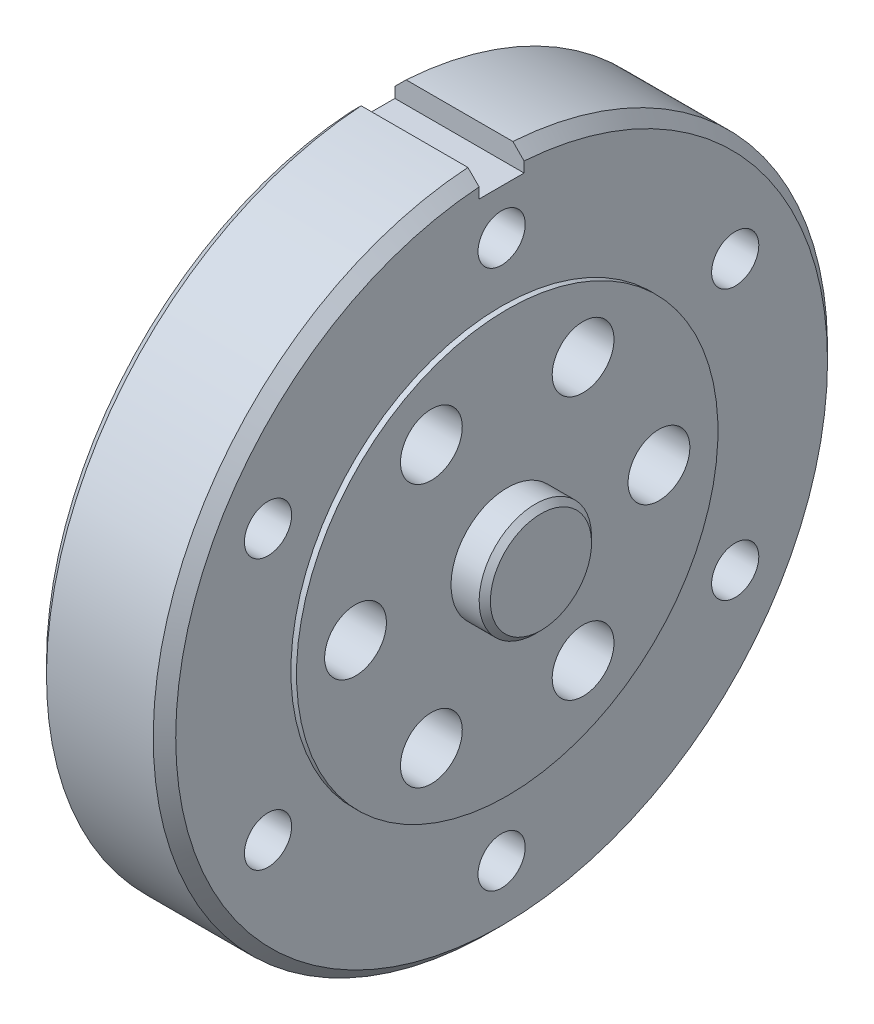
ISO-10303-21;
HEADER;
FILE_DESCRIPTION(('STEP AP214'),'2;1');
FILE_NAME('part.step','',(''),(''),'','','');
FILE_SCHEMA(('AUTOMOTIVE_DESIGN { 1 0 10303 214 1 1 1 1 }'));
ENDSEC;
DATA;
#1=APPLICATION_CONTEXT('core data for automotive mechanical design processes');
#2=APPLICATION_PROTOCOL_DEFINITION('international standard','automotive_design',2000,#1);
#3=PRODUCT_CONTEXT('',#1,'mechanical');
#4=PRODUCT('Part','Part','',(#3));
#5=PRODUCT_RELATED_PRODUCT_CATEGORY('part','',(#4));
#6=PRODUCT_DEFINITION_FORMATION('','',#4);
#7=PRODUCT_DEFINITION_CONTEXT('part definition',#1,'design');
#8=PRODUCT_DEFINITION('design','',#6,#7);
#9=PRODUCT_DEFINITION_SHAPE('','',#8);
#10=(LENGTH_UNIT() NAMED_UNIT(*) SI_UNIT(.MILLI.,.METRE.));
#11=(NAMED_UNIT(*) PLANE_ANGLE_UNIT() SI_UNIT($,.RADIAN.));
#12=(NAMED_UNIT(*) SI_UNIT($,.STERADIAN.) SOLID_ANGLE_UNIT());
#13=UNCERTAINTY_MEASURE_WITH_UNIT(LENGTH_MEASURE(1.E-05),#10,'distance_accuracy_value','');
#14=(GEOMETRIC_REPRESENTATION_CONTEXT(3) GLOBAL_UNCERTAINTY_ASSIGNED_CONTEXT((#13)) GLOBAL_UNIT_ASSIGNED_CONTEXT((#10,
#11,#12)) REPRESENTATION_CONTEXT('',''));
#15=CARTESIAN_POINT('',(0.,0.,0.));
#16=DIRECTION('',(0.,0.,1.));
#17=DIRECTION('',(1.,0.,0.));
#18=AXIS2_PLACEMENT_3D('',#15,#16,#17);
#19=CARTESIAN_POINT('',(-658.280507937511,814.165133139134,284.122324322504));
#20=DIRECTION('',(1.,0.,0.));
#21=DIRECTION('',(0.,1.,0.));
#22=AXIS2_PLACEMENT_3D('',#19,#20,#21);
#23=CYLINDRICAL_SURFACE('',#22,5.);
#24=CARTESIAN_POINT('',(-673.369845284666,814.165133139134,284.122324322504));
#25=DIRECTION('',(-1.,0.,0.));
#26=DIRECTION('',(0.,1.,0.));
#27=AXIS2_PLACEMENT_3D('',#24,#25,#26);
#28=CIRCLE('',#27,5.);
#29=CARTESIAN_POINT('',(-673.369845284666,819.165133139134,284.122324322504));
#30=VERTEX_POINT('',#29);
#31=EDGE_CURVE('E11',#30,#30,#28,.T.);
#32=ORIENTED_EDGE('',*,*,#31,.T.);
#33=EDGE_LOOP('',(#32));
#34=FACE_BOUND('',#33,.T.);
#35=CARTESIAN_POINT('',(-668.869845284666,814.165133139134,284.122324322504));
#36=DIRECTION('',(1.,0.,0.));
#37=DIRECTION('',(0.,-1.,0.));
#38=AXIS2_PLACEMENT_3D('',#35,#36,#37);
#39=CIRCLE('',#38,5.);
#40=CARTESIAN_POINT('',(-668.869845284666,809.165133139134,284.122324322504));
#41=VERTEX_POINT('',#40);
#42=EDGE_CURVE('E28',#41,#41,#39,.T.);
#43=ORIENTED_EDGE('',*,*,#42,.T.);
#44=EDGE_LOOP('',(#43));
#45=FACE_BOUND('',#44,.T.);
#46=ADVANCED_FACE('F17',(#34,#45),#23,.F.);
#47=CARTESIAN_POINT('',(-673.869845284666,814.165133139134,279.122324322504));
#48=DIRECTION('',(-1.,0.,0.));
#49=DIRECTION('',(0.,-1.,0.));
#50=AXIS2_PLACEMENT_3D('',#47,#48,#49);
#51=PLANE('',#50);
#52=DIRECTION('',(0.,-1.,0.));
#53=VECTOR('',#52,1.);
#54=CARTESIAN_POINT('',(-673.869845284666,849.311806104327,282.122324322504));
#55=LINE('',#54,#53);
#56=CARTESIAN_POINT('',(-673.869845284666,843.096085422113,282.122324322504));
#57=VERTEX_POINT('',#56);
#58=CARTESIAN_POINT('',(-673.869845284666,842.165133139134,282.122324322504));
#59=VERTEX_POINT('',#58);
#60=EDGE_CURVE('E249',#57,#59,#55,.T.);
#61=ORIENTED_EDGE('',*,*,#60,.F.);
#62=CARTESIAN_POINT('',(-673.869845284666,814.165133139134,284.122324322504));
#63=DIRECTION('',(-1.,0.,0.));
#64=DIRECTION('',(0.,1.,0.));
#65=AXIS2_PLACEMENT_3D('',#62,#63,#64);
#66=CIRCLE('',#65,29.);
#67=CARTESIAN_POINT('',(-673.869845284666,843.096085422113,286.122324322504));
#68=VERTEX_POINT('',#67);
#69=EDGE_CURVE('E293',#57,#68,#66,.T.);
#70=ORIENTED_EDGE('',*,*,#69,.T.);
#71=DIRECTION('',(0.,1.,0.));
#72=VECTOR('',#71,1.);
#73=CARTESIAN_POINT('',(-673.869845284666,849.311806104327,286.122324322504));
#74=LINE('',#73,#72);
#75=CARTESIAN_POINT('',(-673.869845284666,842.165133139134,286.122324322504));
#76=VERTEX_POINT('',#75);
#77=EDGE_CURVE('E258',#76,#68,#74,.T.);
#78=ORIENTED_EDGE('',*,*,#77,.F.);
#79=DIRECTION('',(0.,0.,1.));
#80=VECTOR('',#79,1.);
#81=CARTESIAN_POINT('',(-673.869845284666,842.165133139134,282.122324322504));
#82=LINE('',#81,#80);
#83=EDGE_CURVE('E266',#59,#76,#82,.T.);
#84=ORIENTED_EDGE('',*,*,#83,.F.);
#85=EDGE_LOOP('',(#61,#70,#78,#84));
#86=FACE_BOUND('',#85,.T.);
#87=CARTESIAN_POINT('',(-673.869845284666,814.165133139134,284.122324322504));
#88=DIRECTION('',(1.,0.,0.));
#89=DIRECTION('',(0.,1.,0.));
#90=AXIS2_PLACEMENT_3D('',#87,#88,#89);
#91=CIRCLE('',#90,5.5);
#92=CARTESIAN_POINT('',(-673.869845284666,819.665133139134,284.122324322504));
#93=VERTEX_POINT('',#92);
#94=EDGE_CURVE('E289',#93,#93,#91,.T.);
#95=ORIENTED_EDGE('',*,*,#94,.T.);
#96=EDGE_LOOP('',(#95));
#97=FACE_BOUND('',#96,.T.);
#98=CARTESIAN_POINT('',(-673.869845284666,802.165133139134,263.337714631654));
#99=DIRECTION('',(-1.,0.,0.));
#100=DIRECTION('',(0.,1.,0.));
#101=AXIS2_PLACEMENT_3D('',#98,#99,#100);
#102=CIRCLE('',#101,2.1);
#103=CARTESIAN_POINT('',(-673.869845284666,804.265133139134,263.337714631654));
#104=VERTEX_POINT('',#103);
#105=EDGE_CURVE('E274',#104,#104,#102,.T.);
#106=ORIENTED_EDGE('',*,*,#105,.F.);
#107=EDGE_LOOP('',(#106));
#108=FACE_BOUND('',#107,.T.);
#109=CARTESIAN_POINT('',(-673.869845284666,790.165133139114,284.122324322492));
#110=DIRECTION('',(-1.,0.,0.));
#111=DIRECTION('',(0.,1.,0.));
#112=AXIS2_PLACEMENT_3D('',#109,#110,#111);
#113=CIRCLE('',#112,2.1);
#114=CARTESIAN_POINT('',(-673.869845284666,792.265133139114,284.122324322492));
#115=VERTEX_POINT('',#114);
#116=EDGE_CURVE('E299',#115,#115,#113,.T.);
#117=ORIENTED_EDGE('',*,*,#116,.F.);
#118=EDGE_LOOP('',(#117));
#119=FACE_BOUND('',#118,.T.);
#120=CARTESIAN_POINT('',(-673.869845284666,802.165133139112,304.906934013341));
#121=DIRECTION('',(-1.,0.,0.));
#122=DIRECTION('',(0.,1.,0.));
#123=AXIS2_PLACEMENT_3D('',#120,#121,#122);
#124=CIRCLE('',#123,2.1);
#125=CARTESIAN_POINT('',(-673.869845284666,804.265133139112,304.906934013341));
#126=VERTEX_POINT('',#125);
#127=EDGE_CURVE('E304',#126,#126,#124,.T.);
#128=ORIENTED_EDGE('',*,*,#127,.F.);
#129=EDGE_LOOP('',(#128));
#130=FACE_BOUND('',#129,.T.);
#131=CARTESIAN_POINT('',(-673.869845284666,826.165133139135,304.906934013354));
#132=DIRECTION('',(-1.,0.,0.));
#133=DIRECTION('',(0.,1.,0.));
#134=AXIS2_PLACEMENT_3D('',#131,#132,#133);
#135=CIRCLE('',#134,2.1);
#136=CARTESIAN_POINT('',(-673.869845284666,828.265133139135,304.906934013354));
#137=VERTEX_POINT('',#136);
#138=EDGE_CURVE('E309',#137,#137,#135,.T.);
#139=ORIENTED_EDGE('',*,*,#138,.F.);
#140=EDGE_LOOP('',(#139));
#141=FACE_BOUND('',#140,.T.);
#142=CARTESIAN_POINT('',(-673.869845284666,838.165133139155,284.122324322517));
#143=DIRECTION('',(-1.,0.,0.));
#144=DIRECTION('',(0.,1.,0.));
#145=AXIS2_PLACEMENT_3D('',#142,#143,#144);
#146=CIRCLE('',#145,2.1);
#147=CARTESIAN_POINT('',(-673.869845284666,840.265133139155,284.122324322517));
#148=VERTEX_POINT('',#147);
#149=EDGE_CURVE('E314',#148,#148,#146,.T.);
#150=ORIENTED_EDGE('',*,*,#149,.F.);
#151=EDGE_LOOP('',(#150));
#152=FACE_BOUND('',#151,.T.);
#153=CARTESIAN_POINT('',(-673.869845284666,826.165133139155,263.337714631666));
#154=DIRECTION('',(-1.,0.,0.));
#155=DIRECTION('',(0.,1.,0.));
#156=AXIS2_PLACEMENT_3D('',#153,#154,#155);
#157=CIRCLE('',#156,2.1);
#158=CARTESIAN_POINT('',(-673.869845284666,828.265133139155,263.337714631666));
#159=VERTEX_POINT('',#158);
#160=EDGE_CURVE('E319',#159,#159,#157,.T.);
#161=ORIENTED_EDGE('',*,*,#160,.F.);
#162=EDGE_LOOP('',(#161));
#163=FACE_BOUND('',#162,.T.);
#164=CARTESIAN_POINT('',(-673.869845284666,802.473790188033,290.872324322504));
#165=DIRECTION('',(-1.,0.,0.));
#166=DIRECTION('',(0.,1.,0.));
#167=AXIS2_PLACEMENT_3D('',#164,#165,#166);
#168=CIRCLE('',#167,5.00000000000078);
#169=CARTESIAN_POINT('',(-673.869845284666,807.473790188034,290.872324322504));
#170=VERTEX_POINT('',#169);
#171=EDGE_CURVE('E205',#170,#170,#168,.T.);
#172=ORIENTED_EDGE('',*,*,#171,.F.);
#173=EDGE_LOOP('',(#172));
#174=FACE_BOUND('',#173,.T.);
#175=CARTESIAN_POINT('',(-673.869845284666,814.165133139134,297.622324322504));
#176=DIRECTION('',(-1.,0.,0.));
#177=DIRECTION('',(0.,1.,0.));
#178=AXIS2_PLACEMENT_3D('',#175,#176,#177);
#179=CIRCLE('',#178,4.99999999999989);
#180=CARTESIAN_POINT('',(-673.869845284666,819.165133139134,297.622324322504));
#181=VERTEX_POINT('',#180);
#182=EDGE_CURVE('E204',#181,#181,#179,.T.);
#183=ORIENTED_EDGE('',*,*,#182,.F.);
#184=EDGE_LOOP('',(#183));
#185=FACE_BOUND('',#184,.T.);
#186=CARTESIAN_POINT('',(-673.869845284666,825.856476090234,290.872324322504));
#187=DIRECTION('',(-1.,0.,0.));
#188=DIRECTION('',(0.,1.,0.));
#189=AXIS2_PLACEMENT_3D('',#186,#187,#188);
#190=CIRCLE('',#189,4.99999999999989);
#191=CARTESIAN_POINT('',(-673.869845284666,830.856476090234,290.872324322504));
#192=VERTEX_POINT('',#191);
#193=EDGE_CURVE('E324',#192,#192,#190,.T.);
#194=ORIENTED_EDGE('',*,*,#193,.F.);
#195=EDGE_LOOP('',(#194));
#196=FACE_BOUND('',#195,.T.);
#197=CARTESIAN_POINT('',(-673.869845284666,825.856476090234,277.372324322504));
#198=DIRECTION('',(-1.,0.,0.));
#199=DIRECTION('',(0.,1.,0.));
#200=AXIS2_PLACEMENT_3D('',#197,#198,#199);
#201=CIRCLE('',#200,4.99999999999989);
#202=CARTESIAN_POINT('',(-673.869845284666,830.856476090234,277.372324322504));
#203=VERTEX_POINT('',#202);
#204=EDGE_CURVE('E329',#203,#203,#201,.T.);
#205=ORIENTED_EDGE('',*,*,#204,.F.);
#206=EDGE_LOOP('',(#205));
#207=FACE_BOUND('',#206,.T.);
#208=CARTESIAN_POINT('',(-673.869845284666,814.165133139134,270.622324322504));
#209=DIRECTION('',(-1.,0.,0.));
#210=DIRECTION('',(0.,1.,0.));
#211=AXIS2_PLACEMENT_3D('',#208,#209,#210);
#212=CIRCLE('',#211,4.99999999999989);
#213=CARTESIAN_POINT('',(-673.869845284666,819.165133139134,270.622324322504));
#214=VERTEX_POINT('',#213);
#215=EDGE_CURVE('E333',#214,#214,#212,.T.);
#216=ORIENTED_EDGE('',*,*,#215,.F.);
#217=EDGE_LOOP('',(#216));
#218=FACE_BOUND('',#217,.T.);
#219=CARTESIAN_POINT('',(-673.869845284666,802.473790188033,277.372324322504));
#220=DIRECTION('',(-1.,0.,0.));
#221=DIRECTION('',(0.,1.,0.));
#222=AXIS2_PLACEMENT_3D('',#219,#220,#221);
#223=CIRCLE('',#222,5.00000000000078);
#224=CARTESIAN_POINT('',(-673.869845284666,807.473790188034,277.372324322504));
#225=VERTEX_POINT('',#224);
#226=EDGE_CURVE('E338',#225,#225,#223,.T.);
#227=ORIENTED_EDGE('',*,*,#226,.F.);
#228=EDGE_LOOP('',(#227));
#229=FACE_BOUND('',#228,.T.);
#230=ADVANCED_FACE('F470',(#86,#97,#108,#119,#130,#141,#152,#163,#174,#185,#196,#207,#218,#229),
#51,.T.);
#231=CARTESIAN_POINT('',(-658.280507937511,814.165133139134,284.122324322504));
#232=DIRECTION('',(1.,0.,0.));
#233=DIRECTION('',(0.,1.,0.));
#234=AXIS2_PLACEMENT_3D('',#231,#232,#233);
#235=CYLINDRICAL_SURFACE('',#234,30.);
#236=DIRECTION('',(-1.,0.,0.));
#237=VECTOR('',#236,1.);
#238=CARTESIAN_POINT('',(-658.280507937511,844.098392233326,282.122324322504));
#239=LINE('',#238,#237);
#240=CARTESIAN_POINT('',(-663.369845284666,844.098392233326,282.122324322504));
#241=VERTEX_POINT('',#240);
#242=CARTESIAN_POINT('',(-672.869845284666,844.098392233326,282.122324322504));
#243=VERTEX_POINT('',#242);
#244=EDGE_CURVE('E229',#241,#243,#239,.T.);
#245=ORIENTED_EDGE('',*,*,#244,.F.);
#246=CARTESIAN_POINT('',(-663.369845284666,814.165133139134,284.122324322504));
#247=DIRECTION('',(-1.,0.,0.));
#248=DIRECTION('',(0.,-1.,0.));
#249=AXIS2_PLACEMENT_3D('',#246,#247,#248);
#250=CIRCLE('',#249,30.);
#251=CARTESIAN_POINT('',(-663.369845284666,844.098392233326,286.122324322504));
#252=VERTEX_POINT('',#251);
#253=EDGE_CURVE('E294',#241,#252,#250,.T.);
#254=ORIENTED_EDGE('',*,*,#253,.T.);
#255=DIRECTION('',(1.,0.,0.));
#256=VECTOR('',#255,1.);
#257=CARTESIAN_POINT('',(-658.280507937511,844.098392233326,286.122324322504));
#258=LINE('',#257,#256);
#259=CARTESIAN_POINT('',(-672.869845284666,844.098392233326,286.122324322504));
#260=VERTEX_POINT('',#259);
#261=EDGE_CURVE('E239',#260,#252,#258,.T.);
#262=ORIENTED_EDGE('',*,*,#261,.F.);
#263=CARTESIAN_POINT('',(-672.869845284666,814.165133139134,284.122324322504));
#264=DIRECTION('',(1.,0.,0.));
#265=DIRECTION('',(0.,1.,0.));
#266=AXIS2_PLACEMENT_3D('',#263,#264,#265);
#267=CIRCLE('',#266,30.);
#268=EDGE_CURVE('E348',#260,#243,#267,.T.);
#269=ORIENTED_EDGE('',*,*,#268,.T.);
#270=EDGE_LOOP('',(#245,#254,#262,#269));
#271=FACE_BOUND('',#270,.T.);
#272=ADVANCED_FACE('F476',(#271),#235,.T.);
#273=CARTESIAN_POINT('',(-662.369845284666,814.165133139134,265.372324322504));
#274=DIRECTION('',(1.,0.,0.));
#275=DIRECTION('',(0.,1.,0.));
#276=AXIS2_PLACEMENT_3D('',#273,#274,#275);
#277=PLANE('',#276);
#278=DIRECTION('',(0.,1.,0.));
#279=VECTOR('',#278,1.);
#280=CARTESIAN_POINT('',(-662.369845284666,814.165133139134,282.122324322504));
#281=LINE('',#280,#279);
#282=CARTESIAN_POINT('',(-662.369845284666,842.165133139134,282.122324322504));
#283=VERTEX_POINT('',#282);
#284=CARTESIAN_POINT('',(-662.369845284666,843.096085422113,282.122324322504));
#285=VERTEX_POINT('',#284);
#286=EDGE_CURVE('E228',#283,#285,#281,.T.);
#287=ORIENTED_EDGE('',*,*,#286,.F.);
#288=DIRECTION('',(0.,0.,-1.));
#289=VECTOR('',#288,1.);
#290=CARTESIAN_POINT('',(-662.369845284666,842.165133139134,265.372324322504));
#291=LINE('',#290,#289);
#292=CARTESIAN_POINT('',(-662.369845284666,842.165133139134,286.122324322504));
#293=VERTEX_POINT('',#292);
#294=EDGE_CURVE('E265',#293,#283,#291,.T.);
#295=ORIENTED_EDGE('',*,*,#294,.F.);
#296=DIRECTION('',(0.,-1.,0.));
#297=VECTOR('',#296,1.);
#298=CARTESIAN_POINT('',(-662.369845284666,814.165133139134,286.122324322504));
#299=LINE('',#298,#297);
#300=CARTESIAN_POINT('',(-662.369845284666,843.096085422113,286.122324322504));
#301=VERTEX_POINT('',#300);
#302=EDGE_CURVE('E355',#301,#293,#299,.T.);
#303=ORIENTED_EDGE('',*,*,#302,.F.);
#304=CARTESIAN_POINT('',(-662.369845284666,814.165133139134,284.122324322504));
#305=DIRECTION('',(1.,0.,0.));
#306=DIRECTION('',(0.,-1.,0.));
#307=AXIS2_PLACEMENT_3D('',#304,#305,#306);
#308=CIRCLE('',#307,29.);
#309=EDGE_CURVE('E353',#301,#285,#308,.T.);
#310=ORIENTED_EDGE('',*,*,#309,.T.);
#311=EDGE_LOOP('',(#287,#295,#303,#310));
#312=FACE_BOUND('',#311,.T.);
#313=CARTESIAN_POINT('',(-662.369845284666,802.165133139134,263.337714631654));
#314=DIRECTION('',(1.,0.,0.));
#315=DIRECTION('',(0.,-1.,0.));
#316=AXIS2_PLACEMENT_3D('',#313,#314,#315);
#317=CIRCLE('',#316,2.1);
#318=CARTESIAN_POINT('',(-662.369845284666,800.065133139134,263.337714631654));
#319=VERTEX_POINT('',#318);
#320=EDGE_CURVE('E298',#319,#319,#317,.T.);
#321=ORIENTED_EDGE('',*,*,#320,.F.);
#322=EDGE_LOOP('',(#321));
#323=FACE_BOUND('',#322,.T.);
#324=CARTESIAN_POINT('',(-662.369845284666,790.165133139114,284.122324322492));
#325=DIRECTION('',(1.,0.,0.));
#326=DIRECTION('',(0.,-1.,0.));
#327=AXIS2_PLACEMENT_3D('',#324,#325,#326);
#328=CIRCLE('',#327,2.1);
#329=CARTESIAN_POINT('',(-662.369845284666,788.065133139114,284.122324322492));
#330=VERTEX_POINT('',#329);
#331=EDGE_CURVE('E303',#330,#330,#328,.T.);
#332=ORIENTED_EDGE('',*,*,#331,.F.);
#333=EDGE_LOOP('',(#332));
#334=FACE_BOUND('',#333,.T.);
#335=CARTESIAN_POINT('',(-662.369845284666,802.165133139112,304.906934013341));
#336=DIRECTION('',(1.,0.,0.));
#337=DIRECTION('',(0.,-1.,0.));
#338=AXIS2_PLACEMENT_3D('',#335,#336,#337);
#339=CIRCLE('',#338,2.1);
#340=CARTESIAN_POINT('',(-662.369845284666,800.065133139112,304.906934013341));
#341=VERTEX_POINT('',#340);
#342=EDGE_CURVE('E308',#341,#341,#339,.T.);
#343=ORIENTED_EDGE('',*,*,#342,.F.);
#344=EDGE_LOOP('',(#343));
#345=FACE_BOUND('',#344,.T.);
#346=CARTESIAN_POINT('',(-662.369845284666,826.165133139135,304.906934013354));
#347=DIRECTION('',(1.,0.,0.));
#348=DIRECTION('',(0.,-1.,0.));
#349=AXIS2_PLACEMENT_3D('',#346,#347,#348);
#350=CIRCLE('',#349,2.1);
#351=CARTESIAN_POINT('',(-662.369845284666,824.065133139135,304.906934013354));
#352=VERTEX_POINT('',#351);
#353=EDGE_CURVE('E313',#352,#352,#350,.T.);
#354=ORIENTED_EDGE('',*,*,#353,.F.);
#355=EDGE_LOOP('',(#354));
#356=FACE_BOUND('',#355,.T.);
#357=CARTESIAN_POINT('',(-662.369845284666,838.165133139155,284.122324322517));
#358=DIRECTION('',(1.,0.,0.));
#359=DIRECTION('',(0.,-1.,0.));
#360=AXIS2_PLACEMENT_3D('',#357,#358,#359);
#361=CIRCLE('',#360,2.1);
#362=CARTESIAN_POINT('',(-662.369845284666,836.065133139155,284.122324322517));
#363=VERTEX_POINT('',#362);
#364=EDGE_CURVE('E318',#363,#363,#361,.T.);
#365=ORIENTED_EDGE('',*,*,#364,.F.);
#366=EDGE_LOOP('',(#365));
#367=FACE_BOUND('',#366,.T.);
#368=CARTESIAN_POINT('',(-662.369845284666,826.165133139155,263.337714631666));
#369=DIRECTION('',(1.,0.,0.));
#370=DIRECTION('',(0.,-1.,0.));
#371=AXIS2_PLACEMENT_3D('',#368,#369,#370);
#372=CIRCLE('',#371,2.1);
#373=CARTESIAN_POINT('',(-662.369845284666,824.065133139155,263.337714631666));
#374=VERTEX_POINT('',#373);
#375=EDGE_CURVE('E322',#374,#374,#372,.T.);
#376=ORIENTED_EDGE('',*,*,#375,.F.);
#377=EDGE_LOOP('',(#376));
#378=FACE_BOUND('',#377,.T.);
#379=CARTESIAN_POINT('',(-662.369845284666,814.165133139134,284.122324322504));
#380=DIRECTION('',(1.,0.,0.));
#381=DIRECTION('',(0.,-1.,0.));
#382=AXIS2_PLACEMENT_3D('',#379,#380,#381);
#383=CIRCLE('',#382,18.75);
#384=CARTESIAN_POINT('',(-662.369845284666,795.415133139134,284.122324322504));
#385=VERTEX_POINT('',#384);
#386=EDGE_CURVE('E361',#385,#385,#383,.T.);
#387=ORIENTED_EDGE('',*,*,#386,.F.);
#388=EDGE_LOOP('',(#387));
#389=FACE_BOUND('',#388,.T.);
#390=ADVANCED_FACE('F483',(#312,#323,#334,#345,#356,#367,#378,#389),#277,.T.);
#391=CARTESIAN_POINT('',(-658.280507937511,814.165133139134,284.122324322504));
#392=DIRECTION('',(1.,0.,0.));
#393=DIRECTION('',(0.,1.,0.));
#394=AXIS2_PLACEMENT_3D('',#391,#392,#393);
#395=CYLINDRICAL_SURFACE('',#394,18.75);
#396=ORIENTED_EDGE('',*,*,#386,.T.);
#397=EDGE_LOOP('',(#396));
#398=FACE_BOUND('',#397,.T.);
#399=CARTESIAN_POINT('',(-661.869845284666,814.165133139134,284.122324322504));
#400=DIRECTION('',(1.,0.,0.));
#401=DIRECTION('',(0.,-1.,0.));
#402=AXIS2_PLACEMENT_3D('',#399,#400,#401);
#403=CIRCLE('',#402,18.75);
#404=CARTESIAN_POINT('',(-661.869845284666,795.415133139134,284.122324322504));
#405=VERTEX_POINT('',#404);
#406=EDGE_CURVE('E383',#405,#405,#403,.T.);
#407=ORIENTED_EDGE('',*,*,#406,.F.);
#408=EDGE_LOOP('',(#407));
#409=FACE_BOUND('',#408,.T.);
#410=ADVANCED_FACE('F487',(#398,#409),#395,.T.);
#411=CARTESIAN_POINT('',(-661.869845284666,814.165133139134,279.122324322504));
#412=DIRECTION('',(1.,0.,0.));
#413=DIRECTION('',(0.,1.,0.));
#414=AXIS2_PLACEMENT_3D('',#411,#412,#413);
#415=PLANE('',#414);
#416=CARTESIAN_POINT('',(-661.869845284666,825.856476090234,290.872324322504));
#417=DIRECTION('',(1.,0.,0.));
#418=DIRECTION('',(0.,-1.,0.));
#419=AXIS2_PLACEMENT_3D('',#416,#417,#418);
#420=CIRCLE('',#419,2.74999999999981);
#421=CARTESIAN_POINT('',(-661.869845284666,823.106476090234,290.872324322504));
#422=VERTEX_POINT('',#421);
#423=EDGE_CURVE('E388',#422,#422,#420,.T.);
#424=ORIENTED_EDGE('',*,*,#423,.F.);
#425=EDGE_LOOP('',(#424));
#426=FACE_BOUND('',#425,.T.);
#427=CARTESIAN_POINT('',(-661.869845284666,814.165133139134,297.622324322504));
#428=DIRECTION('',(1.,0.,0.));
#429=DIRECTION('',(0.,-1.,0.));
#430=AXIS2_PLACEMENT_3D('',#427,#428,#429);
#431=CIRCLE('',#430,2.74999999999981);
#432=CARTESIAN_POINT('',(-661.869845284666,811.415133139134,297.622324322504));
#433=VERTEX_POINT('',#432);
#434=EDGE_CURVE('E393',#433,#433,#431,.T.);
#435=ORIENTED_EDGE('',*,*,#434,.F.);
#436=EDGE_LOOP('',(#435));
#437=FACE_BOUND('',#436,.T.);
#438=CARTESIAN_POINT('',(-661.869845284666,802.473790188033,290.872324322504));
#439=DIRECTION('',(1.,0.,0.));
#440=DIRECTION('',(0.,-1.,0.));
#441=AXIS2_PLACEMENT_3D('',#438,#439,#440);
#442=CIRCLE('',#441,2.7500000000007);
#443=CARTESIAN_POINT('',(-661.869845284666,799.723790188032,290.872324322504));
#444=VERTEX_POINT('',#443);
#445=EDGE_CURVE('E397',#444,#444,#442,.T.);
#446=ORIENTED_EDGE('',*,*,#445,.F.);
#447=EDGE_LOOP('',(#446));
#448=FACE_BOUND('',#447,.T.);
#449=CARTESIAN_POINT('',(-661.869845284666,825.856476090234,277.372324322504));
#450=DIRECTION('',(1.,0.,0.));
#451=DIRECTION('',(0.,-1.,0.));
#452=AXIS2_PLACEMENT_3D('',#449,#450,#451);
#453=CIRCLE('',#452,2.74999999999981);
#454=CARTESIAN_POINT('',(-661.869845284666,823.106476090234,277.372324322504));
#455=VERTEX_POINT('',#454);
#456=EDGE_CURVE('E402',#455,#455,#453,.T.);
#457=ORIENTED_EDGE('',*,*,#456,.F.);
#458=EDGE_LOOP('',(#457));
#459=FACE_BOUND('',#458,.T.);
#460=CARTESIAN_POINT('',(-661.869845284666,814.165133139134,270.622324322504));
#461=DIRECTION('',(1.,0.,0.));
#462=DIRECTION('',(0.,-1.,0.));
#463=AXIS2_PLACEMENT_3D('',#460,#461,#462);
#464=CIRCLE('',#463,2.74999999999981);
#465=CARTESIAN_POINT('',(-661.869845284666,811.415133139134,270.622324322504));
#466=VERTEX_POINT('',#465);
#467=EDGE_CURVE('E407',#466,#466,#464,.T.);
#468=ORIENTED_EDGE('',*,*,#467,.F.);
#469=EDGE_LOOP('',(#468));
#470=FACE_BOUND('',#469,.T.);
#471=CARTESIAN_POINT('',(-661.869845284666,802.473790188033,277.372324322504));
#472=DIRECTION('',(1.,0.,0.));
#473=DIRECTION('',(0.,-1.,0.));
#474=AXIS2_PLACEMENT_3D('',#471,#472,#473);
#475=CIRCLE('',#474,2.7500000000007);
#476=CARTESIAN_POINT('',(-661.869845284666,799.723790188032,277.372324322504));
#477=VERTEX_POINT('',#476);
#478=EDGE_CURVE('E217',#477,#477,#475,.T.);
#479=ORIENTED_EDGE('',*,*,#478,.F.);
#480=EDGE_LOOP('',(#479));
#481=FACE_BOUND('',#480,.T.);
#482=ORIENTED_EDGE('',*,*,#406,.T.);
#483=EDGE_LOOP('',(#482));
#484=FACE_BOUND('',#483,.T.);
#485=CARTESIAN_POINT('',(-661.869845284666,814.165133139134,284.122324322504));
#486=DIRECTION('',(1.,0.,0.));
#487=DIRECTION('',(0.,-1.,0.));
#488=AXIS2_PLACEMENT_3D('',#485,#486,#487);
#489=CIRCLE('',#488,5.);
#490=CARTESIAN_POINT('',(-661.869845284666,809.165133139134,284.122324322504));
#491=VERTEX_POINT('',#490);
#492=EDGE_CURVE('E415',#491,#491,#489,.T.);
#493=ORIENTED_EDGE('',*,*,#492,.F.);
#494=EDGE_LOOP('',(#493));
#495=FACE_BOUND('',#494,.T.);
#496=ADVANCED_FACE('F491',(#426,#437,#448,#459,#470,#481,#484,#495),#415,.T.);
#497=CARTESIAN_POINT('',(-658.280507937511,814.165133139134,284.122324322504));
#498=DIRECTION('',(1.,0.,0.));
#499=DIRECTION('',(0.,1.,0.));
#500=AXIS2_PLACEMENT_3D('',#497,#498,#499);
#501=CYLINDRICAL_SURFACE('',#500,5.);
#502=CARTESIAN_POINT('',(-659.369845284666,814.165133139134,284.122324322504));
#503=DIRECTION('',(-1.,0.,0.));
#504=DIRECTION('',(0.,-1.,0.));
#505=AXIS2_PLACEMENT_3D('',#502,#503,#504);
#506=CIRCLE('',#505,5.);
#507=CARTESIAN_POINT('',(-659.369845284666,809.165133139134,284.122324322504));
#508=VERTEX_POINT('',#507);
#509=EDGE_CURVE('E387',#508,#508,#506,.T.);
#510=ORIENTED_EDGE('',*,*,#509,.T.);
#511=EDGE_LOOP('',(#510));
#512=FACE_BOUND('',#511,.T.);
#513=ORIENTED_EDGE('',*,*,#492,.T.);
#514=EDGE_LOOP('',(#513));
#515=FACE_BOUND('',#514,.T.);
#516=ADVANCED_FACE('F495',(#512,#515),#501,.T.);
#517=CARTESIAN_POINT('',(-658.869845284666,814.165133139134,284.122324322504));
#518=DIRECTION('',(1.,0.,0.));
#519=DIRECTION('',(0.,1.,0.));
#520=AXIS2_PLACEMENT_3D('',#517,#518,#519);
#521=PLANE('',#520);
#522=CARTESIAN_POINT('',(-658.869845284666,814.165133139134,284.122324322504));
#523=DIRECTION('',(1.,0.,0.));
#524=DIRECTION('',(0.,-1.,0.));
#525=AXIS2_PLACEMENT_3D('',#522,#523,#524);
#526=CIRCLE('',#525,4.5);
#527=CARTESIAN_POINT('',(-658.869845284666,809.665133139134,284.122324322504));
#528=VERTEX_POINT('',#527);
#529=EDGE_CURVE('E419',#528,#528,#526,.T.);
#530=ORIENTED_EDGE('',*,*,#529,.T.);
#531=EDGE_LOOP('',(#530));
#532=FACE_BOUND('',#531,.T.);
#533=ADVANCED_FACE('F499',(#532),#521,.T.);
#534=CARTESIAN_POINT('',(-668.869845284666,814.165133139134,284.122324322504));
#535=DIRECTION('',(-1.,0.,0.));
#536=DIRECTION('',(0.,-1.,0.));
#537=AXIS2_PLACEMENT_3D('',#534,#535,#536);
#538=PLANE('',#537);
#539=ORIENTED_EDGE('',*,*,#42,.F.);
#540=EDGE_LOOP('',(#539));
#541=FACE_BOUND('',#540,.T.);
#542=ADVANCED_FACE('F503',(#541),#538,.T.);
#543=CARTESIAN_POINT('',(-667.369845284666,814.165133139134,279.122324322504));
#544=DIRECTION('',(1.,0.,0.));
#545=DIRECTION('',(0.,1.,0.));
#546=AXIS2_PLACEMENT_3D('',#543,#544,#545);
#547=PLANE('',#546);
#548=CARTESIAN_POINT('',(-667.369845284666,802.473790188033,277.372324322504));
#549=DIRECTION('',(-1.,0.,0.));
#550=DIRECTION('',(0.,1.,0.));
#551=AXIS2_PLACEMENT_3D('',#548,#549,#550);
#552=CIRCLE('',#551,2.7500000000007);
#553=CARTESIAN_POINT('',(-667.369845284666,805.223790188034,277.372324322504));
#554=VERTEX_POINT('',#553);
#555=EDGE_CURVE('E411',#554,#554,#552,.T.);
#556=ORIENTED_EDGE('',*,*,#555,.F.);
#557=EDGE_LOOP('',(#556));
#558=FACE_BOUND('',#557,.T.);
#559=CARTESIAN_POINT('',(-667.369845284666,802.473790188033,277.372324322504));
#560=DIRECTION('',(-1.,0.,0.));
#561=DIRECTION('',(0.,-1.,0.));
#562=AXIS2_PLACEMENT_3D('',#559,#560,#561);
#563=CIRCLE('',#562,5.00000000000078);
#564=CARTESIAN_POINT('',(-667.369845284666,797.473790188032,277.372324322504));
#565=VERTEX_POINT('',#564);
#566=EDGE_CURVE('E342',#565,#565,#563,.T.);
#567=ORIENTED_EDGE('',*,*,#566,.T.);
#568=EDGE_LOOP('',(#567));
#569=FACE_BOUND('',#568,.T.);
#570=ADVANCED_FACE('F507',(#558,#569),#547,.F.);
#571=CARTESIAN_POINT('',(-647.727709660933,802.473790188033,277.372324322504));
#572=DIRECTION('',(-1.,0.,0.));
#573=DIRECTION('',(0.,-1.,0.));
#574=AXIS2_PLACEMENT_3D('',#571,#572,#573);
#575=CYLINDRICAL_SURFACE('',#574,5.00000000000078);
#576=ORIENTED_EDGE('',*,*,#226,.T.);
#577=EDGE_LOOP('',(#576));
#578=FACE_BOUND('',#577,.T.);
#579=ORIENTED_EDGE('',*,*,#566,.F.);
#580=EDGE_LOOP('',(#579));
#581=FACE_BOUND('',#580,.T.);
#582=ADVANCED_FACE('F511',(#578,#581),#575,.F.);
#583=CARTESIAN_POINT('',(-667.369845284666,814.165133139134,279.122324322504));
#584=DIRECTION('',(1.,0.,0.));
#585=DIRECTION('',(0.,1.,0.));
#586=AXIS2_PLACEMENT_3D('',#583,#584,#585);
#587=PLANE('',#586);
#588=CARTESIAN_POINT('',(-667.369845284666,814.165133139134,270.622324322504));
#589=DIRECTION('',(-1.,0.,0.));
#590=DIRECTION('',(0.,1.,0.));
#591=AXIS2_PLACEMENT_3D('',#588,#589,#590);
#592=CIRCLE('',#591,2.74999999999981);
#593=CARTESIAN_POINT('',(-667.369845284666,816.915133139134,270.622324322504));
#594=VERTEX_POINT('',#593);
#595=EDGE_CURVE('E406',#594,#594,#592,.T.);
#596=ORIENTED_EDGE('',*,*,#595,.F.);
#597=EDGE_LOOP('',(#596));
#598=FACE_BOUND('',#597,.T.);
#599=CARTESIAN_POINT('',(-667.369845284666,814.165133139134,270.622324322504));
#600=DIRECTION('',(-1.,0.,0.));
#601=DIRECTION('',(0.,-1.,0.));
#602=AXIS2_PLACEMENT_3D('',#599,#600,#601);
#603=CIRCLE('',#602,4.99999999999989);
#604=CARTESIAN_POINT('',(-667.369845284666,809.165133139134,270.622324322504));
#605=VERTEX_POINT('',#604);
#606=EDGE_CURVE('E337',#605,#605,#603,.T.);
#607=ORIENTED_EDGE('',*,*,#606,.T.);
#608=EDGE_LOOP('',(#607));
#609=FACE_BOUND('',#608,.T.);
#610=ADVANCED_FACE('F515',(#598,#609),#587,.F.);
#611=CARTESIAN_POINT('',(-647.727709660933,814.165133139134,270.622324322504));
#612=DIRECTION('',(-1.,0.,0.));
#613=DIRECTION('',(0.,-1.,0.));
#614=AXIS2_PLACEMENT_3D('',#611,#612,#613);
#615=CYLINDRICAL_SURFACE('',#614,4.99999999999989);
#616=ORIENTED_EDGE('',*,*,#215,.T.);
#617=EDGE_LOOP('',(#616));
#618=FACE_BOUND('',#617,.T.);
#619=ORIENTED_EDGE('',*,*,#606,.F.);
#620=EDGE_LOOP('',(#619));
#621=FACE_BOUND('',#620,.T.);
#622=ADVANCED_FACE('F519',(#618,#621),#615,.F.);
#623=CARTESIAN_POINT('',(-667.369845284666,814.165133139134,279.122324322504));
#624=DIRECTION('',(1.,0.,0.));
#625=DIRECTION('',(0.,1.,0.));
#626=AXIS2_PLACEMENT_3D('',#623,#624,#625);
#627=PLANE('',#626);
#628=CARTESIAN_POINT('',(-667.369845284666,825.856476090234,277.372324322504));
#629=DIRECTION('',(-1.,0.,0.));
#630=DIRECTION('',(0.,1.,0.));
#631=AXIS2_PLACEMENT_3D('',#628,#629,#630);
#632=CIRCLE('',#631,2.74999999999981);
#633=CARTESIAN_POINT('',(-667.369845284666,828.606476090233,277.372324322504));
#634=VERTEX_POINT('',#633);
#635=EDGE_CURVE('E401',#634,#634,#632,.T.);
#636=ORIENTED_EDGE('',*,*,#635,.F.);
#637=EDGE_LOOP('',(#636));
#638=FACE_BOUND('',#637,.T.);
#639=CARTESIAN_POINT('',(-667.369845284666,825.856476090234,277.372324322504));
#640=DIRECTION('',(-1.,0.,0.));
#641=DIRECTION('',(0.,-1.,0.));
#642=AXIS2_PLACEMENT_3D('',#639,#640,#641);
#643=CIRCLE('',#642,4.99999999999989);
#644=CARTESIAN_POINT('',(-667.369845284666,820.856476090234,277.372324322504));
#645=VERTEX_POINT('',#644);
#646=EDGE_CURVE('E332',#645,#645,#643,.T.);
#647=ORIENTED_EDGE('',*,*,#646,.T.);
#648=EDGE_LOOP('',(#647));
#649=FACE_BOUND('',#648,.T.);
#650=ADVANCED_FACE('F523',(#638,#649),#627,.F.);
#651=CARTESIAN_POINT('',(-647.727709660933,825.856476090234,277.372324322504));
#652=DIRECTION('',(-1.,0.,0.));
#653=DIRECTION('',(0.,-1.,0.));
#654=AXIS2_PLACEMENT_3D('',#651,#652,#653);
#655=CYLINDRICAL_SURFACE('',#654,4.99999999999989);
#656=ORIENTED_EDGE('',*,*,#204,.T.);
#657=EDGE_LOOP('',(#656));
#658=FACE_BOUND('',#657,.T.);
#659=ORIENTED_EDGE('',*,*,#646,.F.);
#660=EDGE_LOOP('',(#659));
#661=FACE_BOUND('',#660,.T.);
#662=ADVANCED_FACE('F527',(#658,#661),#655,.F.);
#663=CARTESIAN_POINT('',(-667.369845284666,814.165133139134,279.122324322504));
#664=DIRECTION('',(1.,0.,0.));
#665=DIRECTION('',(0.,1.,0.));
#666=AXIS2_PLACEMENT_3D('',#663,#664,#665);
#667=PLANE('',#666);
#668=CARTESIAN_POINT('',(-667.369845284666,825.856476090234,290.872324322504));
#669=DIRECTION('',(-1.,0.,0.));
#670=DIRECTION('',(0.,1.,0.));
#671=AXIS2_PLACEMENT_3D('',#668,#669,#670);
#672=CIRCLE('',#671,2.74999999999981);
#673=CARTESIAN_POINT('',(-667.369845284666,828.606476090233,290.872324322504));
#674=VERTEX_POINT('',#673);
#675=EDGE_CURVE('E379',#674,#674,#672,.T.);
#676=ORIENTED_EDGE('',*,*,#675,.F.);
#677=EDGE_LOOP('',(#676));
#678=FACE_BOUND('',#677,.T.);
#679=CARTESIAN_POINT('',(-667.369845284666,825.856476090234,290.872324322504));
#680=DIRECTION('',(-1.,0.,0.));
#681=DIRECTION('',(0.,-1.,0.));
#682=AXIS2_PLACEMENT_3D('',#679,#680,#681);
#683=CIRCLE('',#682,4.99999999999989);
#684=CARTESIAN_POINT('',(-667.369845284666,820.856476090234,290.872324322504));
#685=VERTEX_POINT('',#684);
#686=EDGE_CURVE('E328',#685,#685,#683,.T.);
#687=ORIENTED_EDGE('',*,*,#686,.T.);
#688=EDGE_LOOP('',(#687));
#689=FACE_BOUND('',#688,.T.);
#690=ADVANCED_FACE('F531',(#678,#689),#667,.F.);
#691=CARTESIAN_POINT('',(-647.727709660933,825.856476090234,290.872324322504));
#692=DIRECTION('',(-1.,0.,0.));
#693=DIRECTION('',(0.,-1.,0.));
#694=AXIS2_PLACEMENT_3D('',#691,#692,#693);
#695=CYLINDRICAL_SURFACE('',#694,4.99999999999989);
#696=ORIENTED_EDGE('',*,*,#193,.T.);
#697=EDGE_LOOP('',(#696));
#698=FACE_BOUND('',#697,.T.);
#699=ORIENTED_EDGE('',*,*,#686,.F.);
#700=EDGE_LOOP('',(#699));
#701=FACE_BOUND('',#700,.T.);
#702=ADVANCED_FACE('F466',(#698,#701),#695,.F.);
#703=CARTESIAN_POINT('',(-667.369845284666,814.165133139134,279.122324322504));
#704=DIRECTION('',(1.,0.,0.));
#705=DIRECTION('',(0.,1.,0.));
#706=AXIS2_PLACEMENT_3D('',#703,#704,#705);
#707=PLANE('',#706);
#708=CARTESIAN_POINT('',(-667.369845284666,814.165133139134,297.622324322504));
#709=DIRECTION('',(-1.,0.,0.));
#710=DIRECTION('',(0.,1.,0.));
#711=AXIS2_PLACEMENT_3D('',#708,#709,#710);
#712=CIRCLE('',#711,2.74999999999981);
#713=CARTESIAN_POINT('',(-667.369845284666,816.915133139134,297.622324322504));
#714=VERTEX_POINT('',#713);
#715=EDGE_CURVE('E392',#714,#714,#712,.T.);
#716=ORIENTED_EDGE('',*,*,#715,.F.);
#717=EDGE_LOOP('',(#716));
#718=FACE_BOUND('',#717,.T.);
#719=CARTESIAN_POINT('',(-667.369845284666,814.165133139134,297.622324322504));
#720=DIRECTION('',(-1.,0.,0.));
#721=DIRECTION('',(0.,-1.,0.));
#722=AXIS2_PLACEMENT_3D('',#719,#720,#721);
#723=CIRCLE('',#722,4.99999999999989);
#724=CARTESIAN_POINT('',(-667.369845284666,809.165133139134,297.622324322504));
#725=VERTEX_POINT('',#724);
#726=EDGE_CURVE('E213',#725,#725,#723,.T.);
#727=ORIENTED_EDGE('',*,*,#726,.T.);
#728=EDGE_LOOP('',(#727));
#729=FACE_BOUND('',#728,.T.);
#730=ADVANCED_FACE('F453',(#718,#729),#707,.F.);
#731=CARTESIAN_POINT('',(-647.727709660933,814.165133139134,297.622324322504));
#732=DIRECTION('',(-1.,0.,0.));
#733=DIRECTION('',(0.,-1.,0.));
#734=AXIS2_PLACEMENT_3D('',#731,#732,#733);
#735=CYLINDRICAL_SURFACE('',#734,4.99999999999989);
#736=ORIENTED_EDGE('',*,*,#182,.T.);
#737=EDGE_LOOP('',(#736));
#738=FACE_BOUND('',#737,.T.);
#739=ORIENTED_EDGE('',*,*,#726,.F.);
#740=EDGE_LOOP('',(#739));
#741=FACE_BOUND('',#740,.T.);
#742=ADVANCED_FACE('F455',(#738,#741),#735,.F.);
#743=CARTESIAN_POINT('',(-667.369845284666,814.165133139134,279.122324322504));
#744=DIRECTION('',(1.,0.,0.));
#745=DIRECTION('',(0.,1.,0.));
#746=AXIS2_PLACEMENT_3D('',#743,#744,#745);
#747=PLANE('',#746);
#748=CARTESIAN_POINT('',(-667.369845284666,802.473790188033,290.872324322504));
#749=DIRECTION('',(-1.,0.,0.));
#750=DIRECTION('',(0.,1.,0.));
#751=AXIS2_PLACEMENT_3D('',#748,#749,#750);
#752=CIRCLE('',#751,2.7500000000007);
#753=CARTESIAN_POINT('',(-667.369845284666,805.223790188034,290.872324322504));
#754=VERTEX_POINT('',#753);
#755=EDGE_CURVE('E196',#754,#754,#752,.T.);
#756=ORIENTED_EDGE('',*,*,#755,.F.);
#757=EDGE_LOOP('',(#756));
#758=FACE_BOUND('',#757,.T.);
#759=CARTESIAN_POINT('',(-667.369845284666,802.473790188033,290.872324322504));
#760=DIRECTION('',(-1.,0.,0.));
#761=DIRECTION('',(0.,-1.,0.));
#762=AXIS2_PLACEMENT_3D('',#759,#760,#761);
#763=CIRCLE('',#762,5.00000000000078);
#764=CARTESIAN_POINT('',(-667.369845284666,797.473790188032,290.872324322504));
#765=VERTEX_POINT('',#764);
#766=EDGE_CURVE('E200',#765,#765,#763,.T.);
#767=ORIENTED_EDGE('',*,*,#766,.T.);
#768=EDGE_LOOP('',(#767));
#769=FACE_BOUND('',#768,.T.);
#770=ADVANCED_FACE('F457',(#758,#769),#747,.F.);
#771=CARTESIAN_POINT('',(-647.727709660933,802.473790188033,290.872324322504));
#772=DIRECTION('',(-1.,0.,0.));
#773=DIRECTION('',(0.,-1.,0.));
#774=AXIS2_PLACEMENT_3D('',#771,#772,#773);
#775=CYLINDRICAL_SURFACE('',#774,5.00000000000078);
#776=ORIENTED_EDGE('',*,*,#171,.T.);
#777=EDGE_LOOP('',(#776));
#778=FACE_BOUND('',#777,.T.);
#779=ORIENTED_EDGE('',*,*,#766,.F.);
#780=EDGE_LOOP('',(#779));
#781=FACE_BOUND('',#780,.T.);
#782=ADVANCED_FACE('F201',(#778,#781),#775,.F.);
#783=CARTESIAN_POINT('',(-658.869845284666,802.473790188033,277.372324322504));
#784=DIRECTION('',(-1.,0.,0.));
#785=DIRECTION('',(0.,-1.,0.));
#786=AXIS2_PLACEMENT_3D('',#783,#784,#785);
#787=CYLINDRICAL_SURFACE('',#786,2.7500000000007);
#788=ORIENTED_EDGE('',*,*,#478,.T.);
#789=EDGE_LOOP('',(#788));
#790=FACE_BOUND('',#789,.T.);
#791=ORIENTED_EDGE('',*,*,#555,.T.);
#792=EDGE_LOOP('',(#791));
#793=FACE_BOUND('',#792,.T.);
#794=ADVANCED_FACE('F577',(#790,#793),#787,.F.);
#795=CARTESIAN_POINT('',(-658.869845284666,814.165133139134,270.622324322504));
#796=DIRECTION('',(-1.,0.,0.));
#797=DIRECTION('',(0.,-1.,0.));
#798=AXIS2_PLACEMENT_3D('',#795,#796,#797);
#799=CYLINDRICAL_SURFACE('',#798,2.74999999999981);
#800=ORIENTED_EDGE('',*,*,#467,.T.);
#801=EDGE_LOOP('',(#800));
#802=FACE_BOUND('',#801,.T.);
#803=ORIENTED_EDGE('',*,*,#595,.T.);
#804=EDGE_LOOP('',(#803));
#805=FACE_BOUND('',#804,.T.);
#806=ADVANCED_FACE('F586',(#802,#805),#799,.F.);
#807=CARTESIAN_POINT('',(-658.869845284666,825.856476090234,277.372324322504));
#808=DIRECTION('',(-1.,0.,0.));
#809=DIRECTION('',(0.,-1.,0.));
#810=AXIS2_PLACEMENT_3D('',#807,#808,#809);
#811=CYLINDRICAL_SURFACE('',#810,2.74999999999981);
#812=ORIENTED_EDGE('',*,*,#456,.T.);
#813=EDGE_LOOP('',(#812));
#814=FACE_BOUND('',#813,.T.);
#815=ORIENTED_EDGE('',*,*,#635,.T.);
#816=EDGE_LOOP('',(#815));
#817=FACE_BOUND('',#816,.T.);
#818=ADVANCED_FACE('F595',(#814,#817),#811,.F.);
#819=CARTESIAN_POINT('',(-658.869845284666,802.473790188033,290.872324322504));
#820=DIRECTION('',(-1.,0.,0.));
#821=DIRECTION('',(0.,-1.,0.));
#822=AXIS2_PLACEMENT_3D('',#819,#820,#821);
#823=CYLINDRICAL_SURFACE('',#822,2.7500000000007);
#824=ORIENTED_EDGE('',*,*,#445,.T.);
#825=EDGE_LOOP('',(#824));
#826=FACE_BOUND('',#825,.T.);
#827=ORIENTED_EDGE('',*,*,#755,.T.);
#828=EDGE_LOOP('',(#827));
#829=FACE_BOUND('',#828,.T.);
#830=ADVANCED_FACE('F604',(#826,#829),#823,.F.);
#831=CARTESIAN_POINT('',(-658.869845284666,814.165133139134,297.622324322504));
#832=DIRECTION('',(-1.,0.,0.));
#833=DIRECTION('',(0.,-1.,0.));
#834=AXIS2_PLACEMENT_3D('',#831,#832,#833);
#835=CYLINDRICAL_SURFACE('',#834,2.74999999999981);
#836=ORIENTED_EDGE('',*,*,#434,.T.);
#837=EDGE_LOOP('',(#836));
#838=FACE_BOUND('',#837,.T.);
#839=ORIENTED_EDGE('',*,*,#715,.T.);
#840=EDGE_LOOP('',(#839));
#841=FACE_BOUND('',#840,.T.);
#842=ADVANCED_FACE('F613',(#838,#841),#835,.F.);
#843=CARTESIAN_POINT('',(-658.869845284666,825.856476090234,290.872324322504));
#844=DIRECTION('',(-1.,0.,0.));
#845=DIRECTION('',(0.,-1.,0.));
#846=AXIS2_PLACEMENT_3D('',#843,#844,#845);
#847=CYLINDRICAL_SURFACE('',#846,2.74999999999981);
#848=ORIENTED_EDGE('',*,*,#423,.T.);
#849=EDGE_LOOP('',(#848));
#850=FACE_BOUND('',#849,.T.);
#851=ORIENTED_EDGE('',*,*,#675,.T.);
#852=EDGE_LOOP('',(#851));
#853=FACE_BOUND('',#852,.T.);
#854=ADVANCED_FACE('F622',(#850,#853),#847,.F.);
#855=CARTESIAN_POINT('',(-673.869845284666,826.165133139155,263.337714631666));
#856=DIRECTION('',(-1.,0.,0.));
#857=DIRECTION('',(0.,-1.,0.));
#858=AXIS2_PLACEMENT_3D('',#855,#856,#857);
#859=CYLINDRICAL_SURFACE('',#858,2.1);
#860=ORIENTED_EDGE('',*,*,#375,.T.);
#861=EDGE_LOOP('',(#860));
#862=FACE_BOUND('',#861,.T.);
#863=ORIENTED_EDGE('',*,*,#160,.T.);
#864=EDGE_LOOP('',(#863));
#865=FACE_BOUND('',#864,.T.);
#866=ADVANCED_FACE('F631',(#862,#865),#859,.F.);
#867=CARTESIAN_POINT('',(-673.869845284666,838.165133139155,284.122324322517));
#868=DIRECTION('',(-1.,0.,0.));
#869=DIRECTION('',(0.,-1.,0.));
#870=AXIS2_PLACEMENT_3D('',#867,#868,#869);
#871=CYLINDRICAL_SURFACE('',#870,2.1);
#872=ORIENTED_EDGE('',*,*,#364,.T.);
#873=EDGE_LOOP('',(#872));
#874=FACE_BOUND('',#873,.T.);
#875=ORIENTED_EDGE('',*,*,#149,.T.);
#876=EDGE_LOOP('',(#875));
#877=FACE_BOUND('',#876,.T.);
#878=ADVANCED_FACE('F640',(#874,#877),#871,.F.);
#879=CARTESIAN_POINT('',(-673.869845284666,826.165133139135,304.906934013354));
#880=DIRECTION('',(-1.,0.,0.));
#881=DIRECTION('',(0.,-1.,0.));
#882=AXIS2_PLACEMENT_3D('',#879,#880,#881);
#883=CYLINDRICAL_SURFACE('',#882,2.1);
#884=ORIENTED_EDGE('',*,*,#353,.T.);
#885=EDGE_LOOP('',(#884));
#886=FACE_BOUND('',#885,.T.);
#887=ORIENTED_EDGE('',*,*,#138,.T.);
#888=EDGE_LOOP('',(#887));
#889=FACE_BOUND('',#888,.T.);
#890=ADVANCED_FACE('F649',(#886,#889),#883,.F.);
#891=CARTESIAN_POINT('',(-673.869845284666,802.165133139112,304.906934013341));
#892=DIRECTION('',(-1.,0.,0.));
#893=DIRECTION('',(0.,-1.,0.));
#894=AXIS2_PLACEMENT_3D('',#891,#892,#893);
#895=CYLINDRICAL_SURFACE('',#894,2.1);
#896=ORIENTED_EDGE('',*,*,#342,.T.);
#897=EDGE_LOOP('',(#896));
#898=FACE_BOUND('',#897,.T.);
#899=ORIENTED_EDGE('',*,*,#127,.T.);
#900=EDGE_LOOP('',(#899));
#901=FACE_BOUND('',#900,.T.);
#902=ADVANCED_FACE('F658',(#898,#901),#895,.F.);
#903=CARTESIAN_POINT('',(-673.869845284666,790.165133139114,284.122324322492));
#904=DIRECTION('',(-1.,0.,0.));
#905=DIRECTION('',(0.,-1.,0.));
#906=AXIS2_PLACEMENT_3D('',#903,#904,#905);
#907=CYLINDRICAL_SURFACE('',#906,2.1);
#908=ORIENTED_EDGE('',*,*,#331,.T.);
#909=EDGE_LOOP('',(#908));
#910=FACE_BOUND('',#909,.T.);
#911=ORIENTED_EDGE('',*,*,#116,.T.);
#912=EDGE_LOOP('',(#911));
#913=FACE_BOUND('',#912,.T.);
#914=ADVANCED_FACE('F667',(#910,#913),#907,.F.);
#915=CARTESIAN_POINT('',(-673.869845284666,802.165133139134,263.337714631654));
#916=DIRECTION('',(-1.,0.,0.));
#917=DIRECTION('',(0.,-1.,0.));
#918=AXIS2_PLACEMENT_3D('',#915,#916,#917);
#919=CYLINDRICAL_SURFACE('',#918,2.1);
#920=ORIENTED_EDGE('',*,*,#320,.T.);
#921=EDGE_LOOP('',(#920));
#922=FACE_BOUND('',#921,.T.);
#923=ORIENTED_EDGE('',*,*,#105,.T.);
#924=EDGE_LOOP('',(#923));
#925=FACE_BOUND('',#924,.T.);
#926=ADVANCED_FACE('F676',(#922,#925),#919,.F.);
#927=CARTESIAN_POINT('',(-662.369845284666,814.165133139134,284.122324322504));
#928=DIRECTION('',(-1.,0.,0.));
#929=DIRECTION('',(0.,-1.,0.));
#930=AXIS2_PLACEMENT_3D('',#927,#928,#929);
#931=CONICAL_SURFACE('',#930,29.,0.785398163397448);
#932=CARTESIAN_POINT('',(-662.369845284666,843.096085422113,282.122324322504));
#933=CARTESIAN_POINT('',(-662.381252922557,843.107520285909,282.122324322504));
#934=CARTESIAN_POINT('',(-662.392660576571,843.118955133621,282.122324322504));
#935=CARTESIAN_POINT('',(-662.725981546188,843.453069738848,282.122324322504));
#936=CARTESIAN_POINT('',(-663.047907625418,843.775736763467,282.122324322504));
#937=CARTESIAN_POINT('',(-663.369845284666,844.098392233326,282.122324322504));
#938=B_SPLINE_CURVE_WITH_KNOTS('',3,(#932,#933,#934,#935,#936,#937),.UNSPECIFIED.,.F.,.F.,(4,2,
4),(0.,0.0342242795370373,1.),.UNSPECIFIED.);
#939=EDGE_CURVE('E222',#285,#241,#938,.T.);
#940=ORIENTED_EDGE('',*,*,#939,.F.);
#941=ORIENTED_EDGE('',*,*,#309,.F.);
#942=CARTESIAN_POINT('',(-663.369845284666,844.098392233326,286.122324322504));
#943=CARTESIAN_POINT('',(-663.047907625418,843.775736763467,286.122324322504));
#944=CARTESIAN_POINT('',(-662.725981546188,843.453069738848,286.122324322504));
#945=CARTESIAN_POINT('',(-662.392660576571,843.118955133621,286.122324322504));
#946=CARTESIAN_POINT('',(-662.381252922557,843.107520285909,286.122324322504));
#947=CARTESIAN_POINT('',(-662.369845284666,843.096085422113,286.122324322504));
#948=B_SPLINE_CURVE_WITH_KNOTS('',3,(#942,#943,#944,#945,#946,#947),.UNSPECIFIED.,.F.,.F.,(4,2,
4),(0.,0.965775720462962,1.),.UNSPECIFIED.);
#949=EDGE_CURVE('E230',#252,#301,#948,.T.);
#950=ORIENTED_EDGE('',*,*,#949,.F.);
#951=ORIENTED_EDGE('',*,*,#253,.F.);
#952=EDGE_LOOP('',(#940,#941,#950,#951));
#953=FACE_BOUND('',#952,.T.);
#954=ADVANCED_FACE('F685',(#953),#931,.T.);
#955=CARTESIAN_POINT('',(-672.869845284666,814.165133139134,284.122324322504));
#956=DIRECTION('',(1.,0.,0.));
#957=DIRECTION('',(0.,1.,0.));
#958=AXIS2_PLACEMENT_3D('',#955,#956,#957);
#959=CONICAL_SURFACE('',#958,30.,0.785398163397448);
#960=CARTESIAN_POINT('',(-672.869845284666,844.098392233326,282.122324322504));
#961=CARTESIAN_POINT('',(-673.191782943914,843.775736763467,282.122324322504));
#962=CARTESIAN_POINT('',(-673.513709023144,843.453069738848,282.122324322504));
#963=CARTESIAN_POINT('',(-673.847029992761,843.118955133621,282.122324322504));
#964=CARTESIAN_POINT('',(-673.858437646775,843.107520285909,282.122324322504));
#965=CARTESIAN_POINT('',(-673.869845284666,843.096085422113,282.122324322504));
#966=B_SPLINE_CURVE_WITH_KNOTS('',3,(#960,#961,#962,#963,#964,#965),.UNSPECIFIED.,.F.,.F.,(4,2,
4),(0.,0.965775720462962,1.),.UNSPECIFIED.);
#967=EDGE_CURVE('E240',#243,#57,#966,.T.);
#968=ORIENTED_EDGE('',*,*,#967,.F.);
#969=ORIENTED_EDGE('',*,*,#268,.F.);
#970=CARTESIAN_POINT('',(-673.869845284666,843.096085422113,286.122324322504));
#971=CARTESIAN_POINT('',(-673.858437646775,843.107520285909,286.122324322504));
#972=CARTESIAN_POINT('',(-673.847029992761,843.118955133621,286.122324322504));
#973=CARTESIAN_POINT('',(-673.513709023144,843.453069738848,286.122324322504));
#974=CARTESIAN_POINT('',(-673.191782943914,843.775736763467,286.122324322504));
#975=CARTESIAN_POINT('',(-672.869845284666,844.098392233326,286.122324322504));
#976=B_SPLINE_CURVE_WITH_KNOTS('',3,(#970,#971,#972,#973,#974,#975),.UNSPECIFIED.,.F.,.F.,(4,2,
4),(0.,0.0342242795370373,1.),.UNSPECIFIED.);
#977=EDGE_CURVE('E250',#68,#260,#976,.T.);
#978=ORIENTED_EDGE('',*,*,#977,.F.);
#979=ORIENTED_EDGE('',*,*,#69,.F.);
#980=EDGE_LOOP('',(#968,#969,#978,#979));
#981=FACE_BOUND('',#980,.T.);
#982=ADVANCED_FACE('F694',(#981),#959,.T.);
#983=CARTESIAN_POINT('',(-658.869845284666,814.165133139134,284.122324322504));
#984=DIRECTION('',(-1.,0.,0.));
#985=DIRECTION('',(0.,-1.,0.));
#986=AXIS2_PLACEMENT_3D('',#983,#984,#985);
#987=CONICAL_SURFACE('',#986,4.5,0.785398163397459);
#988=ORIENTED_EDGE('',*,*,#509,.F.);
#989=EDGE_LOOP('',(#988));
#990=FACE_BOUND('',#989,.T.);
#991=ORIENTED_EDGE('',*,*,#529,.F.);
#992=EDGE_LOOP('',(#991));
#993=FACE_BOUND('',#992,.T.);
#994=ADVANCED_FACE('F703',(#990,#993),#987,.T.);
#995=CARTESIAN_POINT('',(-673.869845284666,814.165133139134,284.122324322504));
#996=DIRECTION('',(-1.,0.,0.));
#997=DIRECTION('',(0.,-1.,0.));
#998=AXIS2_PLACEMENT_3D('',#995,#996,#997);
#999=CONICAL_SURFACE('',#998,5.5,0.785398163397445);
#1000=ORIENTED_EDGE('',*,*,#31,.F.);
#1001=EDGE_LOOP('',(#1000));
#1002=FACE_BOUND('',#1001,.T.);
#1003=ORIENTED_EDGE('',*,*,#94,.F.);
#1004=EDGE_LOOP('',(#1003));
#1005=FACE_BOUND('',#1004,.T.);
#1006=ADVANCED_FACE('F712',(#1002,#1005),#999,.F.);
#1007=CARTESIAN_POINT('',(-658.869845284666,842.165133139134,282.122324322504));
#1008=DIRECTION('',(0.,-1.,0.));
#1009=DIRECTION('',(1.,0.,0.));
#1010=AXIS2_PLACEMENT_3D('',#1007,#1008,#1009);
#1011=PLANE('',#1010);
#1012=ORIENTED_EDGE('',*,*,#294,.T.);
#1013=DIRECTION('',(-1.,0.,0.));
#1014=VECTOR('',#1013,1.);
#1015=CARTESIAN_POINT('',(-658.869845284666,842.165133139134,282.122324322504));
#1016=LINE('',#1015,#1014);
#1017=EDGE_CURVE('E259',#283,#59,#1016,.T.);
#1018=ORIENTED_EDGE('',*,*,#1017,.T.);
#1019=ORIENTED_EDGE('',*,*,#83,.T.);
#1020=DIRECTION('',(-1.,0.,0.));
#1021=VECTOR('',#1020,1.);
#1022=CARTESIAN_POINT('',(-658.869845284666,842.165133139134,286.122324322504));
#1023=LINE('',#1022,#1021);
#1024=EDGE_CURVE('E21',#293,#76,#1023,.T.);
#1025=ORIENTED_EDGE('',*,*,#1024,.F.);
#1026=EDGE_LOOP('',(#1012,#1018,#1019,#1025));
#1027=FACE_BOUND('',#1026,.T.);
#1028=ADVANCED_FACE('F721',(#1027),#1011,.F.);
#1029=CARTESIAN_POINT('',(-658.869845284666,849.311806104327,282.122324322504));
#1030=DIRECTION('',(0.,0.,-1.));
#1031=DIRECTION('',(0.,-1.,0.));
#1032=AXIS2_PLACEMENT_3D('',#1029,#1030,#1031);
#1033=PLANE('',#1032);
#1034=ORIENTED_EDGE('',*,*,#286,.T.);
#1035=ORIENTED_EDGE('',*,*,#939,.T.);
#1036=ORIENTED_EDGE('',*,*,#244,.T.);
#1037=ORIENTED_EDGE('',*,*,#967,.T.);
#1038=ORIENTED_EDGE('',*,*,#60,.T.);
#1039=ORIENTED_EDGE('',*,*,#1017,.F.);
#1040=EDGE_LOOP('',(#1034,#1035,#1036,#1037,#1038,#1039));
#1041=FACE_BOUND('',#1040,.T.);
#1042=ADVANCED_FACE('F729',(#1041),#1033,.F.);
#1043=CARTESIAN_POINT('',(-658.869845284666,849.311806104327,286.122324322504));
#1044=DIRECTION('',(0.,0.,1.));
#1045=DIRECTION('',(0.,1.,0.));
#1046=AXIS2_PLACEMENT_3D('',#1043,#1044,#1045);
#1047=PLANE('',#1046);
#1048=ORIENTED_EDGE('',*,*,#302,.T.);
#1049=ORIENTED_EDGE('',*,*,#1024,.T.);
#1050=ORIENTED_EDGE('',*,*,#77,.T.);
#1051=ORIENTED_EDGE('',*,*,#977,.T.);
#1052=ORIENTED_EDGE('',*,*,#261,.T.);
#1053=ORIENTED_EDGE('',*,*,#949,.T.);
#1054=EDGE_LOOP('',(#1048,#1049,#1050,#1051,#1052,#1053));
#1055=FACE_BOUND('',#1054,.T.);
#1056=ADVANCED_FACE('F19',(#1055),#1047,.F.);
#1057=CLOSED_SHELL('',(#46,#230,#272,#390,#410,#496,#516,#533,#542,#570,#582,#610,#622,#650,
#662,#690,#702,#730,#742,#770,#782,#794,#806,#818,#830,#842,#854,#866,#878,#890,#902,#914,#926,
#954,#982,#994,#1006,#1028,#1042,#1056));
#1058=MANIFOLD_SOLID_BREP('B1',#1057);
#1059=ADVANCED_BREP_SHAPE_REPRESENTATION('',(#18,#1058),#14);
#1060=SHAPE_DEFINITION_REPRESENTATION(#9,#1059);
ENDSEC;
END-ISO-10303-21;
